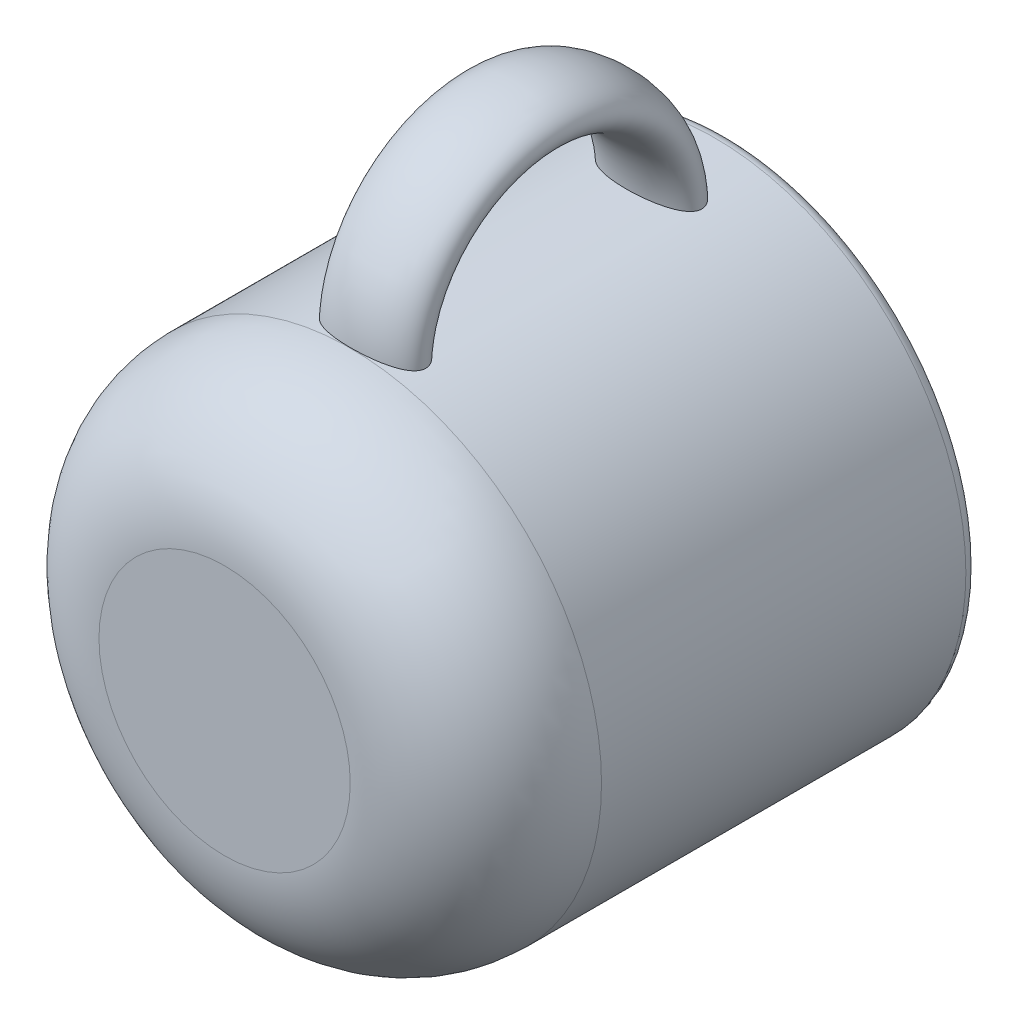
ISO-10303-21;
HEADER;
FILE_DESCRIPTION(('STEP AP214'),'2;1');
FILE_NAME('part.step','',(''),(''),'','','');
FILE_SCHEMA(('AUTOMOTIVE_DESIGN { 1 0 10303 214 1 1 1 1 }'));
ENDSEC;
DATA;
#1=APPLICATION_CONTEXT('core data for automotive mechanical design processes');
#2=APPLICATION_PROTOCOL_DEFINITION('international standard','automotive_design',2000,#1);
#3=PRODUCT_CONTEXT('',#1,'mechanical');
#4=PRODUCT('Part','Part','',(#3));
#5=PRODUCT_RELATED_PRODUCT_CATEGORY('part','',(#4));
#6=PRODUCT_DEFINITION_FORMATION('','',#4);
#7=PRODUCT_DEFINITION_CONTEXT('part definition',#1,'design');
#8=PRODUCT_DEFINITION('design','',#6,#7);
#9=PRODUCT_DEFINITION_SHAPE('','',#8);
#10=(LENGTH_UNIT() NAMED_UNIT(*) SI_UNIT(.MILLI.,.METRE.));
#11=(NAMED_UNIT(*) PLANE_ANGLE_UNIT() SI_UNIT($,.RADIAN.));
#12=(NAMED_UNIT(*) SI_UNIT($,.STERADIAN.) SOLID_ANGLE_UNIT());
#13=UNCERTAINTY_MEASURE_WITH_UNIT(LENGTH_MEASURE(1.E-05),#10,'distance_accuracy_value','');
#14=(GEOMETRIC_REPRESENTATION_CONTEXT(3) GLOBAL_UNCERTAINTY_ASSIGNED_CONTEXT((#13)) GLOBAL_UNIT_ASSIGNED_CONTEXT((#10,
#11,#12)) REPRESENTATION_CONTEXT('',''));
#15=CARTESIAN_POINT('',(0.,0.,0.));
#16=DIRECTION('',(0.,0.,1.));
#17=DIRECTION('',(1.,0.,0.));
#18=AXIS2_PLACEMENT_3D('',#15,#16,#17);
#19=CARTESIAN_POINT('',(0.,0.,200.));
#20=DIRECTION('',(0.,0.,-1.));
#21=DIRECTION('',(-1.,0.,0.));
#22=AXIS2_PLACEMENT_3D('',#19,#20,#21);
#23=CYLINDRICAL_SURFACE('',#22,100.);
#24=CARTESIAN_POINT('',(0.,0.,5.));
#25=DIRECTION('',(0.,0.,1.));
#26=DIRECTION('',(1.,0.,0.));
#27=AXIS2_PLACEMENT_3D('',#24,#25,#26);
#28=CIRCLE('',#27,100.);
#29=CARTESIAN_POINT('',(100.,0.,5.));
#30=VERTEX_POINT('',#29);
#31=EDGE_CURVE('E36',#30,#30,#28,.T.);
#32=ORIENTED_EDGE('',*,*,#31,.T.);
#33=EDGE_LOOP('',(#32));
#34=FACE_BOUND('',#33,.T.);
#35=CARTESIAN_POINT('',(-20.,97.9795897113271,30.0700787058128));
#36=CARTESIAN_POINT('',(-19.9999979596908,97.979590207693,30.222520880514));
#37=CARTESIAN_POINT('',(-19.9930275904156,97.9810137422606,30.3749876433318));
#38=CARTESIAN_POINT('',(-19.9653726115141,97.9866526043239,30.6786777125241));
#39=CARTESIAN_POINT('',(-19.9446807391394,97.9908694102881,30.8299003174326));
#40=CARTESIAN_POINT('',(-19.8901208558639,98.0019584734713,31.1301554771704));
#41=CARTESIAN_POINT('',(-19.8562263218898,98.0088360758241,31.2791829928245));
#42=CARTESIAN_POINT('',(-19.7761375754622,98.0250276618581,31.5737707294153));
#43=CARTESIAN_POINT('',(-19.729940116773,98.0343422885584,31.7193300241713));
#44=CARTESIAN_POINT('',(-19.6145049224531,98.0575106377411,32.0388254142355));
#45=CARTESIAN_POINT('',(-19.5424171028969,98.0719148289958,32.211694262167));
#46=CARTESIAN_POINT('',(-19.383367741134,98.103474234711,32.5501404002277));
#47=CARTESIAN_POINT('',(-19.2964020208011,98.1206302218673,32.7157156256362));
#48=CARTESIAN_POINT('',(-19.0160353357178,98.1754877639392,33.2011532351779));
#49=CARTESIAN_POINT('',(-18.8032316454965,98.216565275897,33.5095525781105));
#50=CARTESIAN_POINT('',(-18.389019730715,98.294856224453,34.0334226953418));
#51=CARTESIAN_POINT('',(-18.1946247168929,98.3310658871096,34.2547978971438));
#52=CARTESIAN_POINT('',(-17.7873297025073,98.4055574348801,34.6796614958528));
#53=CARTESIAN_POINT('',(-17.5744185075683,98.4438405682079,34.883138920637));
#54=CARTESIAN_POINT('',(-17.1337203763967,98.5214992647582,35.2737414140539));
#55=CARTESIAN_POINT('',(-16.9059074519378,98.5608766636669,35.4608365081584));
#56=CARTESIAN_POINT('',(-16.4385770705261,98.6398975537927,35.8197670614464));
#57=CARTESIAN_POINT('',(-16.1990565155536,98.6795411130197,35.9915984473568));
#58=CARTESIAN_POINT('',(-15.655632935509,98.7673677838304,36.3583277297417));
#59=CARTESIAN_POINT('',(-15.3493611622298,98.8154671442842,36.5497271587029));
#60=CARTESIAN_POINT('',(-14.7254407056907,98.9103690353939,36.9137135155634));
#61=CARTESIAN_POINT('',(-14.4077843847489,98.9571706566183,37.0862874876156));
#62=CARTESIAN_POINT('',(-13.7633834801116,99.0488527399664,37.4142455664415));
#63=CARTESIAN_POINT('',(-13.4366365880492,99.0937327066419,37.569625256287));
#64=CARTESIAN_POINT('',(-12.7752636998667,99.1811680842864,37.8647890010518));
#65=CARTESIAN_POINT('',(-12.4406259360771,99.2237196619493,38.0045477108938));
#66=CARTESIAN_POINT('',(-11.7653781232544,99.3060498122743,38.2692931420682));
#67=CARTESIAN_POINT('',(-11.4247702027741,99.3458293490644,38.3942850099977));
#68=CARTESIAN_POINT('',(-10.7384718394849,99.4223539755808,38.6304967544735));
#69=CARTESIAN_POINT('',(-10.3927810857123,99.459098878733,38.7417157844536));
#70=CARTESIAN_POINT('',(-9.61321163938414,99.5378039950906,38.9764172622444));
#71=CARTESIAN_POINT('',(-9.1781832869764,99.5788828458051,39.0963820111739));
#72=CARTESIAN_POINT('',(-8.30283976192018,99.6556870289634,39.3174382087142));
#73=CARTESIAN_POINT('',(-7.86252371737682,99.6914114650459,39.4185264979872));
#74=CARTESIAN_POINT('',(-6.97750832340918,99.7572622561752,39.6027422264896));
#75=CARTESIAN_POINT('',(-6.53280684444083,99.7873857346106,39.685860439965));
#76=CARTESIAN_POINT('',(-5.6401899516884,99.8418159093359,39.8347406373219));
#77=CARTESIAN_POINT('',(-5.19227470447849,99.866122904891,39.9005035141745));
#78=CARTESIAN_POINT('',(-4.29310384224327,99.908819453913,40.0152956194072));
#79=CARTESIAN_POINT('',(-3.8418433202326,99.9271970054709,40.0642909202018));
#80=CARTESIAN_POINT('',(-2.93761360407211,99.9578673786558,40.1457160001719));
#81=CARTESIAN_POINT('',(-2.48464424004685,99.9701595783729,40.1781440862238));
#82=CARTESIAN_POINT('',(-1.12452340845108,99.9977835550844,40.2509235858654));
#83=CARTESIAN_POINT('',(-0.215702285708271,100.003884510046,40.2668278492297));
#84=CARTESIAN_POINT('',(1.31698520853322,99.9932824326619,40.2389844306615));
#85=CARTESIAN_POINT('',(1.94130408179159,99.9830993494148,40.2122973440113));
#86=CARTESIAN_POINT('',(3.18768867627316,99.9511234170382,40.1278706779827));
#87=CARTESIAN_POINT('',(3.80975406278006,99.9293289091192,40.0701266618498));
#88=CARTESIAN_POINT('',(5.04988829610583,99.8743415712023,39.9227806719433));
#89=CARTESIAN_POINT('',(5.66795518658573,99.8411435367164,39.8331641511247));
#90=CARTESIAN_POINT('',(6.89497410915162,99.7638985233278,39.6212569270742));
#91=CARTESIAN_POINT('',(7.50395447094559,99.7199005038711,39.4991134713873));
#92=CARTESIAN_POINT('',(8.71284643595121,99.6215537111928,39.2201157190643));
#93=CARTESIAN_POINT('',(9.31276146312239,99.5672089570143,39.0632748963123));
#94=CARTESIAN_POINT('',(10.5001465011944,99.4489930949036,38.7122357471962));
#95=CARTESIAN_POINT('',(11.0876277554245,99.3851310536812,38.5180729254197));
#96=CARTESIAN_POINT('',(11.9694150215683,99.2815496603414,38.1910382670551));
#97=CARTESIAN_POINT('',(12.2697038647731,99.244871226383,38.0731976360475));
#98=CARTESIAN_POINT('',(12.8650003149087,99.1694595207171,37.8254761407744));
#99=CARTESIAN_POINT('',(13.1600085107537,99.1307264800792,37.69559662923));
#100=CARTESIAN_POINT('',(13.744134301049,99.0514298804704,37.4227421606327));
#101=CARTESIAN_POINT('',(14.0332439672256,99.0108640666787,37.2797508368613));
#102=CARTESIAN_POINT('',(14.6039167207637,98.9283009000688,36.9797476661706));
#103=CARTESIAN_POINT('',(14.8854798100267,98.8863035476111,36.8227358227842));
#104=CARTESIAN_POINT('',(15.4416824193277,98.8009829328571,36.4920742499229));
#105=CARTESIAN_POINT('',(15.7162463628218,98.7576516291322,36.3182988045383));
#106=CARTESIAN_POINT('',(16.2538609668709,98.6705941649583,35.953633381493));
#107=CARTESIAN_POINT('',(16.5169089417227,98.6268679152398,35.7627394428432));
#108=CARTESIAN_POINT('',(17.0278312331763,98.5399406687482,35.362549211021));
#109=CARTESIAN_POINT('',(17.2757395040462,98.4967386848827,35.1532968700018));
#110=CARTESIAN_POINT('',(17.7527455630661,98.4118828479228,34.7142929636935));
#111=CARTESIAN_POINT('',(17.9818569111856,98.3702278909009,34.4845564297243));
#112=CARTESIAN_POINT('',(18.4350605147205,98.2863470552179,33.9812334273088));
#113=CARTESIAN_POINT('',(18.6569511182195,98.2443913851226,33.7055683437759));
#114=CARTESIAN_POINT('',(18.960728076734,98.1860557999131,33.2711531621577));
#115=CARTESIAN_POINT('',(19.0571698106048,98.1673717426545,33.122811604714));
#116=CARTESIAN_POINT('',(19.2388608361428,98.1319253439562,32.8191165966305));
#117=CARTESIAN_POINT('',(19.3241084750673,98.1151632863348,32.6637621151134));
#118=CARTESIAN_POINT('',(19.4828000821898,98.0837761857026,32.3441432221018));
#119=CARTESIAN_POINT('',(19.5560615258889,98.0691844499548,32.1797843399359));
#120=CARTESIAN_POINT('',(19.6874246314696,98.0428977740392,31.8449623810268));
#121=CARTESIAN_POINT('',(19.7455356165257,98.0312010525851,31.674503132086));
#122=CARTESIAN_POINT('',(19.8448057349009,98.0111537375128,31.3287861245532));
#123=CARTESIAN_POINT('',(19.8859920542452,98.0027977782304,31.1535365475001));
#124=CARTESIAN_POINT('',(19.9500672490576,97.9897744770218,30.7995856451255));
#125=CARTESIAN_POINT('',(19.9729602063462,97.9851063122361,30.6208850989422));
#126=CARTESIAN_POINT('',(19.9977362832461,97.9800524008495,30.2863547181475));
#127=CARTESIAN_POINT('',(20.0020470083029,97.9791718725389,30.1307087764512));
#128=CARTESIAN_POINT('',(19.9961571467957,97.9803741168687,29.8197103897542));
#129=CARTESIAN_POINT('',(19.985957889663,97.9824566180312,29.6643579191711));
#130=CARTESIAN_POINT('',(19.9512994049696,97.9895196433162,29.3552644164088));
#131=CARTESIAN_POINT('',(19.9268341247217,97.9945013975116,29.2015240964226));
#132=CARTESIAN_POINT('',(19.8642890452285,98.0071988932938,28.896967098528));
#133=CARTESIAN_POINT('',(19.8262090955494,98.0149146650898,28.7461504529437));
#134=CARTESIAN_POINT('',(19.7416488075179,98.0319793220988,28.4627699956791));
#135=CARTESIAN_POINT('',(19.6963261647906,98.0411002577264,28.3298440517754));
#136=CARTESIAN_POINT('',(19.5961518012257,98.0611719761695,28.0677568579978));
#137=CARTESIAN_POINT('',(19.5412968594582,98.0721233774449,27.9385968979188));
#138=CARTESIAN_POINT('',(19.3637752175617,98.1073835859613,27.5575036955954));
#139=CARTESIAN_POINT('',(19.2280923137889,98.1341105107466,27.3117649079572));
#140=CARTESIAN_POINT('',(18.9514840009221,98.1878711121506,26.8741656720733));
#141=CARTESIAN_POINT('',(18.8143791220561,98.2142608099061,26.6797445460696));
#142=CARTESIAN_POINT('',(18.5236863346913,98.2695015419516,26.3038773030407));
#143=CARTESIAN_POINT('',(18.3700886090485,98.2983540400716,26.122439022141));
#144=CARTESIAN_POINT('',(18.0491168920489,98.3577963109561,25.7717418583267));
#145=CARTESIAN_POINT('',(17.8817089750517,98.388390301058,25.6025150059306));
#146=CARTESIAN_POINT('',(17.5358190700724,98.4506269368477,25.2759118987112));
#147=CARTESIAN_POINT('',(17.3573327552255,98.4822699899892,25.1185403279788));
#148=CARTESIAN_POINT('',(17.0137992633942,98.5421594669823,24.8335834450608));
#149=CARTESIAN_POINT('',(16.8497989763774,98.5703450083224,24.7047151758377));
#150=CARTESIAN_POINT('',(16.5158956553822,98.6268416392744,24.455009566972));
#151=CARTESIAN_POINT('',(16.3459938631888,98.6551527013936,24.3341705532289));
#152=CARTESIAN_POINT('',(15.8284302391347,98.7399758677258,23.9826871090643));
#153=CARTESIAN_POINT('',(15.4731041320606,98.7963439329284,23.7632341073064));
#154=CARTESIAN_POINT('',(14.7469717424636,98.9073409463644,23.3504112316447));
#155=CARTESIAN_POINT('',(14.3761468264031,98.9619676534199,23.1570740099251));
#156=CARTESIAN_POINT('',(13.6227994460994,99.0684820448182,22.7937501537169));
#157=CARTESIAN_POINT('',(13.2402740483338,99.1203690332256,22.6237694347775));
#158=CARTESIAN_POINT('',(12.3725437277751,99.2328321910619,22.2662429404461));
#159=CARTESIAN_POINT('',(11.8848786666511,99.2924752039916,22.0843902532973));
#160=CARTESIAN_POINT('',(10.8987941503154,99.4055475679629,21.7494186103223));
#161=CARTESIAN_POINT('',(10.4003675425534,99.4589726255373,21.5963194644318));
#162=CARTESIAN_POINT('',(9.39543573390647,99.5589315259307,21.3162755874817));
#163=CARTESIAN_POINT('',(8.88892838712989,99.6054635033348,21.1893379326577));
#164=CARTESIAN_POINT('',(7.86849546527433,99.691271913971,20.9593212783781));
#165=CARTESIAN_POINT('',(7.35455347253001,99.7305282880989,20.8563080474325));
#166=CARTESIAN_POINT('',(6.32229645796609,99.8012831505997,20.6730769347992));
#167=CARTESIAN_POINT('',(5.80398302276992,99.8327843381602,20.5928511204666));
#168=CARTESIAN_POINT('',(4.76406940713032,99.8878111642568,20.4540269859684));
#169=CARTESIAN_POINT('',(4.24246920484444,99.9113367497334,20.3954288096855));
#170=CARTESIAN_POINT('',(3.02746731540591,99.9565614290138,20.2834338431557));
#171=CARTESIAN_POINT('',(2.33321524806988,99.9751931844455,20.2378887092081));
#172=CARTESIAN_POINT('',(0.9428663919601,99.9979732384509,20.1822871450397));
#173=CARTESIAN_POINT('',(0.246769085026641,100.002116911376,20.1722420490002));
#174=CARTESIAN_POINT('',(-1.14527094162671,99.9958648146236,20.1874545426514));
#175=CARTESIAN_POINT('',(-1.84121347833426,99.9854630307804,20.2127267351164));
#176=CARTESIAN_POINT('',(-3.22786484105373,99.9502877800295,20.2989978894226));
#177=CARTESIAN_POINT('',(-3.91858350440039,99.9255693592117,20.3598600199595));
#178=CARTESIAN_POINT('',(-5.29486484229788,99.8620988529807,20.5185589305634));
#179=CARTESIAN_POINT('',(-5.98042939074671,99.8233521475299,20.6163815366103));
#180=CARTESIAN_POINT('',(-7.34349814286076,99.7323367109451,20.8512730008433));
#181=CARTESIAN_POINT('',(-8.02100782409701,99.680077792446,20.9883133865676));
#182=CARTESIAN_POINT('',(-9.11472680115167,99.5846438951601,21.2462668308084));
#183=CARTESIAN_POINT('',(-9.53436061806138,99.5453242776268,21.3542070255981));
#184=CARTESIAN_POINT('',(-10.3680650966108,99.4619455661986,21.5882074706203));
#185=CARTESIAN_POINT('',(-10.7821362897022,99.4178869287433,21.7142659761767));
#186=CARTESIAN_POINT('',(-11.6044077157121,99.3252705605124,21.9863818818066));
#187=CARTESIAN_POINT('',(-12.0125893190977,99.2767011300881,22.1324917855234));
#188=CARTESIAN_POINT('',(-12.8200939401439,99.1756554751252,22.4463859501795));
#189=CARTESIAN_POINT('',(-13.2194174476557,99.1231794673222,22.6141690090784));
#190=CARTESIAN_POINT('',(-13.8787621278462,99.0325805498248,22.9154189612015));
#191=CARTESIAN_POINT('',(-14.1419043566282,98.9953313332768,23.0423328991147));
#192=CARTESIAN_POINT('',(-14.6619883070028,98.9196397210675,23.30809369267));
#193=CARTESIAN_POINT('',(-14.9189292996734,98.8811971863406,23.4469419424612));
#194=CARTESIAN_POINT('',(-15.4254412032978,98.8034485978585,23.737711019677));
#195=CARTESIAN_POINT('',(-15.675006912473,98.7641419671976,23.8896407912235));
#196=CARTESIAN_POINT('',(-16.163614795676,98.685350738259,24.2068870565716));
#197=CARTESIAN_POINT('',(-16.4027052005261,98.6458681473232,24.3721293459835));
#198=CARTESIAN_POINT('',(-16.869419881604,98.5671276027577,24.7179433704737));
#199=CARTESIAN_POINT('',(-17.09705041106,98.527869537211,24.8985065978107));
#200=CARTESIAN_POINT('',(-17.5378492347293,98.4503620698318,25.2763076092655));
#201=CARTESIAN_POINT('',(-17.751036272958,98.4121114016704,25.4735230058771));
#202=CARTESIAN_POINT('',(-18.0805259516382,98.3519744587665,25.8065541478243));
#203=CARTESIAN_POINT('',(-18.2024686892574,98.3294694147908,25.9366948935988));
#204=CARTESIAN_POINT('',(-18.438423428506,98.2854970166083,26.2041626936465));
#205=CARTESIAN_POINT('',(-18.5524361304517,98.2640295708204,26.341489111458));
#206=CARTESIAN_POINT('',(-18.7713036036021,98.2224545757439,26.6236371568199));
#207=CARTESIAN_POINT('',(-18.876151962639,98.2023479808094,26.7684639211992));
#208=CARTESIAN_POINT('',(-19.0751193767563,98.1638940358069,27.0656402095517));
#209=CARTESIAN_POINT('',(-19.1692348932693,98.14554726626,27.217992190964));
#210=CARTESIAN_POINT('',(-19.3462752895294,98.1108041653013,27.532289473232));
#211=CARTESIAN_POINT('',(-19.4290168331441,98.0944402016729,27.6943423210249));
#212=CARTESIAN_POINT('',(-19.5796976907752,98.064475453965,28.0253544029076));
#213=CARTESIAN_POINT('',(-19.6476468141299,98.0508728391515,28.1943089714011));
#214=CARTESIAN_POINT('',(-19.766722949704,98.0269368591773,28.537700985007));
#215=CARTESIAN_POINT('',(-19.8179028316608,98.0165932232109,28.7121192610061));
#216=CARTESIAN_POINT('',(-19.9020351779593,97.9995452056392,29.065378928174));
#217=CARTESIAN_POINT('',(-19.9350037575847,97.9928376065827,29.244216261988));
#218=CARTESIAN_POINT('',(-19.972149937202,97.985271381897,29.5313184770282));
#219=CARTESIAN_POINT('',(-19.982581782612,97.983143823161,29.6387747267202));
#220=CARTESIAN_POINT('',(-19.9965080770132,97.9803027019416,29.8541760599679));
#221=CARTESIAN_POINT('',(-20.0000014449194,97.9795893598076,29.9621212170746));
#222=CARTESIAN_POINT('',(-20.,97.9795897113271,30.0700787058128));
#223=B_SPLINE_CURVE_WITH_KNOTS('',3,(#35,#36,#37,#38,#39,#40,#41,#42,#43,#44,#45,#46,#47,#48,
#49,#50,#51,#52,#53,#54,#55,#56,#57,#58,#59,#60,#61,#62,#63,#64,#65,#66,#67,#68,#69,#70,#71,#72,
#73,#74,#75,#76,#77,#78,#79,#80,#81,#82,#83,#84,#85,#86,#87,#88,#89,#90,#91,#92,#93,#94,#95,#96,
#97,#98,#99,#100,#101,#102,#103,#104,#105,#106,#107,#108,#109,#110,#111,#112,#113,#114,#115,
#116,#117,#118,#119,#120,#121,#122,#123,#124,#125,#126,#127,#128,#129,#130,#131,#132,#133,#134,
#135,#136,#137,#138,#139,#140,#141,#142,#143,#144,#145,#146,#147,#148,#149,#150,#151,#152,#153,
#154,#155,#156,#157,#158,#159,#160,#161,#162,#163,#164,#165,#166,#167,#168,#169,#170,#171,#172,
#173,#174,#175,#176,#177,#178,#179,#180,#181,#182,#183,#184,#185,#186,#187,#188,#189,#190,#191,
#192,#193,#194,#195,#196,#197,#198,#199,#200,#201,#202,#203,#204,#205,#206,#207,#208,#209,#210,
#211,#212,#213,#214,#215,#216,#217,#218,#219,#220,#221,#222),.UNSPECIFIED.,.T.,.F.,(4,2,2,2,2,2,
2,2,2,2,2,2,2,2,2,2,2,2,2,2,2,2,2,2,2,2,2,2,2,2,2,2,2,2,2,2,2,2,2,2,2,2,2,2,2,2,2,2,2,2,2,2,2,2,
2,2,2,2,2,2,2,2,2,2,2,2,2,2,2,2,2,2,2,2,2,2,2,2,2,2,2,2,2,2,2,2,2,2,2,2,2,2,2,4),(0.,
0.457206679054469,0.914655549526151,1.37302817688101,1.83152186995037,2.39419393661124,
2.95702427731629,4.08324126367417,4.9726407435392,5.86258171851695,6.75411838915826,
7.64589226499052,8.73814206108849,9.83113887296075,10.9244158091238,12.0194416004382,
13.1140846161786,14.208794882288,15.5676866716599,16.9268056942,18.2866208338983,
19.6463659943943,21.0088464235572,22.3714660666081,25.095325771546,26.9694851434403,
28.8439123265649,30.7191961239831,32.5861308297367,34.4523418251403,36.3167861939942,
37.2905482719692,38.2642010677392,39.2390862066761,40.2139710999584,41.1968391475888,
42.1799352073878,43.1607387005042,44.1408283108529,45.2068569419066,45.7402087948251,
46.2736393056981,46.8145590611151,47.3551451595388,47.8948594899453,48.4344533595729,
48.9008924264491,49.3672887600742,49.8338831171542,50.3004826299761,50.7222792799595,
51.1442187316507,51.9874984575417,52.7046300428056,53.4221908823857,54.1415701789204,
54.861232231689,55.492385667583,56.123407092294,57.3862043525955,58.650566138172,
59.9152475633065,61.4857683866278,63.0573672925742,64.6293907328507,66.205685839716,
67.7814315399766,69.3571877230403,71.4440363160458,73.5315511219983,75.6199293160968,
77.7003307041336,79.7799350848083,81.8580334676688,83.162884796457,84.4676105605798,
85.7758202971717,87.0839575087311,87.9672368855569,88.8506195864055,89.7346111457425,
90.6139772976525,91.4928582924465,92.3705759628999,92.9095819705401,93.4485403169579,
93.9878727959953,94.5273825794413,95.0747649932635,95.621783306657,96.1670600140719,
96.7118534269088,97.0355905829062,97.3593781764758),.UNSPECIFIED.);
#224=CARTESIAN_POINT('',(-20.,97.9795897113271,30.0700787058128));
#225=VERTEX_POINT('',#224);
#226=EDGE_CURVE('E49',#225,#225,#223,.T.);
#227=ORIENTED_EDGE('',*,*,#226,.F.);
#228=EDGE_LOOP('',(#227));
#229=FACE_BOUND('',#228,.T.);
#230=CARTESIAN_POINT('',(0.,0.,150.));
#231=DIRECTION('',(0.,0.,1.));
#232=DIRECTION('',(1.,0.,0.));
#233=AXIS2_PLACEMENT_3D('',#230,#231,#232);
#234=CIRCLE('',#233,100.);
#235=CARTESIAN_POINT('',(100.,0.,150.));
#236=VERTEX_POINT('',#235);
#237=EDGE_CURVE('E76',#236,#236,#234,.F.);
#238=ORIENTED_EDGE('',*,*,#237,.T.);
#239=EDGE_LOOP('',(#238));
#240=FACE_BOUND('',#239,.T.);
#241=CARTESIAN_POINT('',(-20.,97.9795897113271,139.929215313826));
#242=CARTESIAN_POINT('',(-19.9999981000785,97.9795901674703,140.079774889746));
#243=CARTESIAN_POINT('',(-19.9931994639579,97.9809786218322,140.230352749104));
#244=CARTESIAN_POINT('',(-19.9661492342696,97.9864943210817,140.530252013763));
#245=CARTESIAN_POINT('',(-19.9458955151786,97.9906219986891,140.679573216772));
#246=CARTESIAN_POINT('',(-19.8924184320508,98.0014919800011,140.975902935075));
#247=CARTESIAN_POINT('',(-19.8591836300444,98.0082365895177,141.12290929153));
#248=CARTESIAN_POINT('',(-19.7805401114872,98.0241390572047,141.413473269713));
#249=CARTESIAN_POINT('',(-19.7351314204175,98.0332969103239,141.557030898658));
#250=CARTESIAN_POINT('',(-19.633544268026,98.0536923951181,141.838758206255));
#251=CARTESIAN_POINT('',(-19.5774585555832,98.0649120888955,141.976962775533));
#252=CARTESIAN_POINT('',(-19.4553131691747,98.0892179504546,142.24874432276));
#253=CARTESIAN_POINT('',(-19.389249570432,98.1023048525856,142.382319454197));
#254=CARTESIAN_POINT('',(-19.1777029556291,98.1439568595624,142.77550759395));
#255=CARTESIAN_POINT('',(-19.0188060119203,98.1749250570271,143.027738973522));
#256=CARTESIAN_POINT('',(-18.6949737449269,98.237068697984,143.480938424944));
#257=CARTESIAN_POINT('',(-18.5332974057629,98.2677306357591,143.684367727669));
#258=CARTESIAN_POINT('',(-18.1927769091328,98.3313422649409,144.076092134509));
#259=CARTESIAN_POINT('',(-18.013921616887,98.3642934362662,144.264377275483));
#260=CARTESIAN_POINT('',(-17.642055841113,98.4316701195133,144.627001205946));
#261=CARTESIAN_POINT('',(-17.4490103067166,98.4660991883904,144.801303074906));
#262=CARTESIAN_POINT('',(-17.051719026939,98.5356766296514,145.13657351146));
#263=CARTESIAN_POINT('',(-16.8474689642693,98.5708252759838,145.297536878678));
#264=CARTESIAN_POINT('',(-16.4509635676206,98.63773143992,145.591477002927));
#265=CARTESIAN_POINT('',(-16.2595782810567,98.6694731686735,145.725638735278));
#266=CARTESIAN_POINT('',(-15.8706569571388,98.7327760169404,145.984669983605));
#267=CARTESIAN_POINT('',(-15.6731219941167,98.7643371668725,146.109541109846));
#268=CARTESIAN_POINT('',(-15.2726613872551,98.8270555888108,146.350758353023));
#269=CARTESIAN_POINT('',(-15.069731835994,98.858212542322,146.467098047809));
#270=CARTESIAN_POINT('',(-14.6593672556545,98.9198971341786,146.691740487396));
#271=CARTESIAN_POINT('',(-14.4519316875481,98.9504246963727,146.800042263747));
#272=CARTESIAN_POINT('',(-13.8232652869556,99.0408830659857,147.113965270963));
#273=CARTESIAN_POINT('',(-13.3961869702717,99.0996089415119,147.308300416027));
#274=CARTESIAN_POINT('',(-12.5305619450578,99.2127802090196,147.670255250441));
#275=CARTESIAN_POINT('',(-12.0920174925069,99.2672264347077,147.837880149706));
#276=CARTESIAN_POINT('',(-11.1102302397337,99.3823769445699,148.182845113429));
#277=CARTESIAN_POINT('',(-10.5648374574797,99.4418918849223,148.354459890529));
#278=CARTESIAN_POINT('',(-9.46398808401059,99.5526963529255,148.666084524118));
#279=CARTESIAN_POINT('',(-8.9085251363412,99.6039804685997,148.806073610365));
#280=CARTESIAN_POINT('',(-7.79022167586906,99.6976799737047,149.057052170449));
#281=CARTESIAN_POINT('',(-7.22737915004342,99.7400928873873,149.168033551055));
#282=CARTESIAN_POINT('',(-6.09526219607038,99.815681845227,149.363121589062));
#283=CARTESIAN_POINT('',(-5.52597682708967,99.8488384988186,149.447171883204));
#284=CARTESIAN_POINT('',(-4.38393020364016,99.90549497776,149.589462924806));
#285=CARTESIAN_POINT('',(-3.81117021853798,99.9289981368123,149.647712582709));
#286=CARTESIAN_POINT('',(-2.66340234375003,99.9661741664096,149.739366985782));
#287=CARTESIAN_POINT('',(-2.088394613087,99.9798477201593,149.772773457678));
#288=CARTESIAN_POINT('',(-0.899603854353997,99.9978342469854,149.816658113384));
#289=CARTESIAN_POINT('',(-0.285749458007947,100.001474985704,149.825490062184));
#290=CARTESIAN_POINT('',(0.941782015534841,99.997449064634,149.815694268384));
#291=CARTESIAN_POINT('',(1.55545905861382,99.9897809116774,149.79706289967));
#292=CARTESIAN_POINT('',(2.78128673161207,99.9631951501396,149.732001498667));
#293=CARTESIAN_POINT('',(3.39343685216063,99.944274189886,149.685563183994));
#294=CARTESIAN_POINT('',(4.61223726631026,99.8954345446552,149.564280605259));
#295=CARTESIAN_POINT('',(5.21889947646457,99.865556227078,149.489540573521));
#296=CARTESIAN_POINT('',(6.42704169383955,99.7950859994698,149.310296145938));
#297=CARTESIAN_POINT('',(7.02852301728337,99.754496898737,149.205799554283));
#298=CARTESIAN_POINT('',(8.22402677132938,99.6630542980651,148.96506769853));
#299=CARTESIAN_POINT('',(8.81805339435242,99.6122068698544,148.828851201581));
#300=CARTESIAN_POINT('',(9.79020048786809,99.5203507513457,148.575452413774));
#301=CARTESIAN_POINT('',(10.1712052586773,99.4821163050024,148.468262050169));
#302=CARTESIAN_POINT('',(10.9280261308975,99.4018258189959,148.238170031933));
#303=CARTESIAN_POINT('',(11.3038426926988,99.3597701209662,148.115269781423));
#304=CARTESIAN_POINT('',(12.0498877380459,99.2720583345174,147.852194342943));
#305=CARTESIAN_POINT('',(12.4201026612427,99.2263947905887,147.7119830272));
#306=CARTESIAN_POINT('',(13.1525382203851,99.1319678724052,147.412899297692));
#307=CARTESIAN_POINT('',(13.514759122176,99.0832046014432,147.254027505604));
#308=CARTESIAN_POINT('',(14.232815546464,98.9826231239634,146.913898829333));
#309=CARTESIAN_POINT('',(14.5885469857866,98.9307786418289,146.732428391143));
#310=CARTESIAN_POINT('',(15.2869033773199,98.8252768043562,146.345845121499));
#311=CARTESIAN_POINT('',(15.6295232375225,98.7716187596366,146.140723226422));
#312=CARTESIAN_POINT('',(16.2961581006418,98.6638159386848,145.704602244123));
#313=CARTESIAN_POINT('',(16.620239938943,98.6096738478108,145.473706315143));
#314=CARTESIAN_POINT('',(17.0886345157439,98.5292026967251,145.105025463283));
#315=CARTESIAN_POINT('',(17.241761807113,98.5025116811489,144.978456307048));
#316=CARTESIAN_POINT('',(17.5411461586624,98.4496381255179,144.717358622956));
#317=CARTESIAN_POINT('',(17.6874048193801,98.4234554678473,144.582831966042));
#318=CARTESIAN_POINT('',(17.9576528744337,98.3744867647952,144.31919968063));
#319=CARTESIAN_POINT('',(18.0824075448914,98.3516226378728,144.190894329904));
#320=CARTESIAN_POINT('',(18.3243113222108,98.306839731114,143.927140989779));
#321=CARTESIAN_POINT('',(18.4414611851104,98.2849208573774,143.791693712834));
#322=CARTESIAN_POINT('',(18.6669602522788,98.24234203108,143.513340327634));
#323=CARTESIAN_POINT('',(18.7753055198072,98.2216826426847,143.37043092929));
#324=CARTESIAN_POINT('',(18.9817039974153,98.1820042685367,143.077042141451));
#325=CARTESIAN_POINT('',(19.0797539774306,98.1629857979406,142.926560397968));
#326=CARTESIAN_POINT('',(19.2650845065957,98.126783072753,142.616092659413));
#327=CARTESIAN_POINT('',(19.352204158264,98.1096266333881,142.456006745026));
#328=CARTESIAN_POINT('',(19.5121803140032,98.077935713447,142.128689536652));
#329=CARTESIAN_POINT('',(19.5850458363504,98.0633995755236,141.961462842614));
#330=CARTESIAN_POINT('',(19.7145454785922,98.0374472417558,141.620865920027));
#331=CARTESIAN_POINT('',(19.7712052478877,98.0260261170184,141.44750589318));
#332=CARTESIAN_POINT('',(19.8666606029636,98.006725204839,141.095731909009));
#333=CARTESIAN_POINT('',(19.9054599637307,97.9988446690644,140.91731902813));
#334=CARTESIAN_POINT('',(19.9606518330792,97.9876169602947,140.576938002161));
#335=CARTESIAN_POINT('',(19.9790301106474,97.9838683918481,140.415304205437));
#336=CARTESIAN_POINT('',(20.0000183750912,97.9795865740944,140.090972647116));
#337=CARTESIAN_POINT('',(20.0026295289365,97.97905308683,139.928274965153));
#338=CARTESIAN_POINT('',(19.9920470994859,97.9812128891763,139.603400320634));
#339=CARTESIAN_POINT('',(19.9788511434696,97.9839066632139,139.441223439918));
#340=CARTESIAN_POINT('',(19.9371185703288,97.9924066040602,139.118953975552));
#341=CARTESIAN_POINT('',(19.9085823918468,97.9982126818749,138.958861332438));
#342=CARTESIAN_POINT('',(19.8420800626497,98.0116974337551,138.664299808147));
#343=CARTESIAN_POINT('',(19.8059947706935,98.0189998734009,138.529382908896));
#344=CARTESIAN_POINT('',(19.7238844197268,98.0355554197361,138.262709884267));
#345=CARTESIAN_POINT('',(19.6778564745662,98.0448090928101,138.130954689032));
#346=CARTESIAN_POINT('',(19.5261324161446,98.075179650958,137.741362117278));
#347=CARTESIAN_POINT('',(19.4067527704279,98.0989149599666,137.48901386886));
#348=CARTESIAN_POINT('',(19.0538758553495,98.1682164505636,136.847868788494));
#349=CARTESIAN_POINT('',(18.795830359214,98.2181235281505,136.473086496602));
#350=CARTESIAN_POINT('',(18.3686230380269,98.2986020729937,135.945058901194));
#351=CARTESIAN_POINT('',(18.219202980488,98.3264237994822,135.774444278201));
#352=CARTESIAN_POINT('',(17.9090901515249,98.3833787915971,135.443972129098));
#353=CARTESIAN_POINT('',(17.7483995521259,98.4125118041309,135.284112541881));
#354=CARTESIAN_POINT('',(17.4403952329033,98.4675258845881,134.995843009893));
#355=CARTESIAN_POINT('',(17.2942714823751,98.4933046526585,134.866127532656));
#356=CARTESIAN_POINT('',(16.9960292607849,98.545207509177,134.613834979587));
#357=CARTESIAN_POINT('',(16.8439100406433,98.5713316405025,134.491258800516));
#358=CARTESIAN_POINT('',(16.3796608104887,98.6499116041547,134.133504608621));
#359=CARTESIAN_POINT('',(16.0597553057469,98.7025541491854,133.908407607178));
#360=CARTESIAN_POINT('',(15.4039085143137,98.8070351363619,133.481916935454));
#361=CARTESIAN_POINT('',(15.0679441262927,98.8588722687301,133.280558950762));
#362=CARTESIAN_POINT('',(14.3837212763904,98.9607410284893,132.899334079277));
#363=CARTESIAN_POINT('',(14.0354596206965,99.0107721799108,132.719472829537));
#364=CARTESIAN_POINT('',(13.2508648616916,99.119141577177,132.341498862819));
#365=CARTESIAN_POINT('',(12.8121368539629,99.1768596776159,132.148192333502));
#366=CARTESIAN_POINT('',(11.9232620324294,99.2876460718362,131.787672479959));
#367=CARTESIAN_POINT('',(11.4731078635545,99.3407112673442,131.620476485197));
#368=CARTESIAN_POINT('',(10.5639314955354,99.4415034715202,131.310067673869));
#369=CARTESIAN_POINT('',(10.10490711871,99.4892291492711,131.166860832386));
#370=CARTESIAN_POINT('',(9.17915563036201,99.578912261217,130.902566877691));
#371=CARTESIAN_POINT('',(8.71241672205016,99.6208597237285,130.781517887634));
#372=CARTESIAN_POINT('',(7.77362322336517,99.6985083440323,130.560589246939));
#373=CARTESIAN_POINT('',(7.30157041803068,99.734211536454,130.460702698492));
#374=CARTESIAN_POINT('',(6.35319874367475,99.7991121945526,130.281079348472));
#375=CARTESIAN_POINT('',(5.87687970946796,99.82830940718,130.201343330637));
#376=CARTESIAN_POINT('',(4.91115090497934,99.8805248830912,130.059864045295));
#377=CARTESIAN_POINT('',(4.42167416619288,99.9034028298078,129.998527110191));
#378=CARTESIAN_POINT('',(3.4403218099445,99.9420099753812,129.895565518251));
#379=CARTESIAN_POINT('',(2.94844592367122,99.957738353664,129.853943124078));
#380=CARTESIAN_POINT('',(1.96310007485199,99.9819443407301,129.790063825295));
#381=CARTESIAN_POINT('',(1.46962963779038,99.9904195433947,129.767813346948));
#382=CARTESIAN_POINT('',(0.482066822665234,100.000057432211,129.74251989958));
#383=CARTESIAN_POINT('',(-0.0120256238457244,100.001219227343,129.739479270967));
#384=CARTESIAN_POINT('',(-0.999647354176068,99.9962220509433,129.75258383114));
#385=CARTESIAN_POINT('',(-1.49317679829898,99.9900671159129,129.768718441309));
#386=CARTESIAN_POINT('',(-2.4790235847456,99.9704830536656,129.820282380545));
#387=CARTESIAN_POINT('',(-2.9713410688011,99.9570548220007,129.855709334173));
#388=CARTESIAN_POINT('',(-3.95373365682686,99.9230175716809,129.946129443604));
#389=CARTESIAN_POINT('',(-4.44380958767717,99.9024114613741,130.001114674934));
#390=CARTESIAN_POINT('',(-5.42090348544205,99.854158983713,130.131120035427));
#391=CARTESIAN_POINT('',(-5.90792172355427,99.8265132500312,130.206138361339));
#392=CARTESIAN_POINT('',(-7.00708643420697,99.7560993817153,130.399631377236));
#393=CARTESIAN_POINT('',(-7.61801381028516,99.7112646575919,130.524358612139));
#394=CARTESIAN_POINT('',(-8.83088201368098,99.6111721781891,130.809018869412));
#395=CARTESIAN_POINT('',(-9.43282236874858,99.5559138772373,130.968953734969));
#396=CARTESIAN_POINT('',(-10.3258193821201,99.4659082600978,131.237233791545));
#397=CARTESIAN_POINT('',(-10.6215798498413,99.4347502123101,131.331295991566));
#398=CARTESIAN_POINT('',(-11.2094871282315,99.3701906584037,131.529387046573));
#399=CARTESIAN_POINT('',(-11.5016342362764,99.3367893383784,131.633415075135));
#400=CARTESIAN_POINT('',(-12.0816232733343,99.2679184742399,131.851957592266));
#401=CARTESIAN_POINT('',(-12.3694666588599,99.2324496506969,131.966468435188));
#402=CARTESIAN_POINT('',(-12.9401874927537,99.1596404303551,132.206660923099));
#403=CARTESIAN_POINT('',(-13.2230654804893,99.1223002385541,132.332341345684));
#404=CARTESIAN_POINT('',(-13.8123563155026,99.0419923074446,132.609486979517));
#405=CARTESIAN_POINT('',(-14.1181263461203,98.9988450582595,132.762274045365));
#406=CARTESIAN_POINT('',(-14.7209313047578,98.9110050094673,133.083710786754));
#407=CARTESIAN_POINT('',(-15.0179682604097,98.8663125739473,133.252356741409));
#408=CARTESIAN_POINT('',(-15.6013110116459,98.775939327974,133.607069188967));
#409=CARTESIAN_POINT('',(-15.8876177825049,98.7302586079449,133.793134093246));
#410=CARTESIAN_POINT('',(-16.446736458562,98.6386587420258,134.184498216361));
#411=CARTESIAN_POINT('',(-16.7195524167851,98.5927396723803,134.389791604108));
#412=CARTESIAN_POINT('',(-17.1703010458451,98.5150581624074,134.758276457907));
#413=CARTESIAN_POINT('',(-17.3525678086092,98.4830989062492,134.916124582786));
#414=CARTESIAN_POINT('',(-17.7067409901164,98.4200368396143,135.243294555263));
#415=CARTESIAN_POINT('',(-17.8786466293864,98.3889340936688,135.412617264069));
#416=CARTESIAN_POINT('',(-18.2096263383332,98.3282145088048,135.763276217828));
#417=CARTESIAN_POINT('',(-18.3687175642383,98.2985957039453,135.944595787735));
#418=CARTESIAN_POINT('',(-18.6714107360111,98.2415500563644,136.319918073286));
#419=CARTESIAN_POINT('',(-18.8150196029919,98.214122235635,136.5139150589));
#420=CARTESIAN_POINT('',(-19.1328491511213,98.1527836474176,136.98902062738));
#421=CARTESIAN_POINT('',(-19.2989362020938,98.1201925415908,137.275950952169));
#422=CARTESIAN_POINT('',(-19.5133349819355,98.0776994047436,137.723154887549));
#423=CARTESIAN_POINT('',(-19.5789886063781,98.0646055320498,137.874944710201));
#424=CARTESIAN_POINT('',(-19.6973939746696,98.0408910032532,138.183694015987));
#425=CARTESIAN_POINT('',(-19.7501492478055,98.0302696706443,138.340652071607));
#426=CARTESIAN_POINT('',(-19.8290161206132,98.0143421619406,138.615671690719));
#427=CARTESIAN_POINT('',(-19.8584736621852,98.0083756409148,138.732744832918));
#428=CARTESIAN_POINT('',(-19.9093521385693,97.9980529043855,138.968688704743));
#429=CARTESIAN_POINT('',(-19.9307744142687,97.9936964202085,139.087559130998));
#430=CARTESIAN_POINT('',(-19.9652179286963,97.9866847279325,139.326582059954));
#431=CARTESIAN_POINT('',(-19.9782380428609,97.9840297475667,139.446734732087));
#432=CARTESIAN_POINT('',(-19.9956288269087,97.9804822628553,139.687659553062));
#433=CARTESIAN_POINT('',(-20.0000015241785,97.9795893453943,139.808431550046));
#434=CARTESIAN_POINT('',(-20.,97.9795897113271,139.929215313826));
#435=B_SPLINE_CURVE_WITH_KNOTS('',3,(#241,#242,#243,#244,#245,#246,#247,#248,#249,#250,#251,
#252,#253,#254,#255,#256,#257,#258,#259,#260,#261,#262,#263,#264,#265,#266,#267,#268,#269,#270,
#271,#272,#273,#274,#275,#276,#277,#278,#279,#280,#281,#282,#283,#284,#285,#286,#287,#288,#289,
#290,#291,#292,#293,#294,#295,#296,#297,#298,#299,#300,#301,#302,#303,#304,#305,#306,#307,#308,
#309,#310,#311,#312,#313,#314,#315,#316,#317,#318,#319,#320,#321,#322,#323,#324,#325,#326,#327,
#328,#329,#330,#331,#332,#333,#334,#335,#336,#337,#338,#339,#340,#341,#342,#343,#344,#345,#346,
#347,#348,#349,#350,#351,#352,#353,#354,#355,#356,#357,#358,#359,#360,#361,#362,#363,#364,#365,
#366,#367,#368,#369,#370,#371,#372,#373,#374,#375,#376,#377,#378,#379,#380,#381,#382,#383,#384,
#385,#386,#387,#388,#389,#390,#391,#392,#393,#394,#395,#396,#397,#398,#399,#400,#401,#402,#403,
#404,#405,#406,#407,#408,#409,#410,#411,#412,#413,#414,#415,#416,#417,#418,#419,#420,#421,#422,
#423,#424,#425,#426,#427,#428,#429,#430,#431,#432,#433,#434),.UNSPECIFIED.,.T.,.F.,(4,2,2,2,2,2,
2,2,2,2,2,2,2,2,2,2,2,2,2,2,2,2,2,2,2,2,2,2,2,2,2,2,2,2,2,2,2,2,2,2,2,2,2,2,2,2,2,2,2,2,2,2,2,2,
2,2,2,2,2,2,2,2,2,2,2,2,2,2,2,2,2,2,2,2,2,2,2,2,2,2,2,2,2,2,2,2,2,2,2,2,2,2,2,2,2,2,4),(0.,
0.451551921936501,0.903175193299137,1.35519730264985,1.8072184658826,2.25547877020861,
2.70391585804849,3.60029495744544,4.38420774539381,5.16863211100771,5.95506375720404,
6.74180058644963,7.44913186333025,8.15634025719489,8.8640756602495,9.57189619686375,
10.9893356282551,12.4064982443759,14.1298370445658,15.8543043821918,17.5792523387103,
19.3077871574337,21.0357245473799,22.7635418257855,24.6046013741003,26.445904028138,
28.2877553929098,30.1228883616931,31.9575404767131,33.7911098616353,34.9837143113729,
36.1762122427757,37.3712423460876,38.5662326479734,39.7735214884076,40.981274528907,
42.1843561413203,42.785484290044,43.3864716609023,43.9274410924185,44.4683566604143,
45.0095127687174,45.5508381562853,46.099376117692,46.6475659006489,47.1948831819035,
47.7420847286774,48.2294686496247,48.716816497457,49.204237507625,49.6916445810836,
50.1107767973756,50.5300308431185,51.3679772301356,52.7329983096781,53.4181616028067,
54.1031932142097,54.6942281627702,55.2853371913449,56.4680305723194,57.652479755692,
58.8372388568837,60.2848938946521,61.7335056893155,63.1824777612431,64.6339198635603,
66.0848881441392,67.5359128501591,69.0169544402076,70.4981659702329,71.9798686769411,
73.4617519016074,74.9428179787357,76.4237017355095,77.9039861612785,79.3841373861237,
81.2584915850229,83.1329439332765,84.0685439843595,85.0040665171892,85.9392649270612,
86.8743611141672,87.9075183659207,88.9404338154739,89.9732551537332,91.0057642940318,
91.7350237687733,92.4643380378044,93.1926590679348,93.9206531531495,94.9160703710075,
95.4132852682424,95.9103639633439,96.2727105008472,96.6349965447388,96.997331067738,
97.3595806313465),.UNSPECIFIED.);
#436=CARTESIAN_POINT('',(-20.,97.9795897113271,139.929215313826));
#437=VERTEX_POINT('',#436);
#438=EDGE_CURVE('E40',#437,#437,#435,.T.);
#439=ORIENTED_EDGE('',*,*,#438,.F.);
#440=EDGE_LOOP('',(#439));
#441=FACE_BOUND('',#440,.T.);
#442=ADVANCED_FACE('F28',(#34,#229,#240,#441),#23,.T.);
#443=CARTESIAN_POINT('',(0.,0.,200.));
#444=DIRECTION('',(0.,0.,1.));
#445=DIRECTION('',(1.,0.,0.));
#446=AXIS2_PLACEMENT_3D('',#443,#444,#445);
#447=PLANE('',#446);
#448=CARTESIAN_POINT('',(0.,0.,200.));
#449=DIRECTION('',(0.,0.,1.));
#450=DIRECTION('',(1.,0.,0.));
#451=AXIS2_PLACEMENT_3D('',#448,#449,#450);
#452=CIRCLE('',#451,50.);
#453=CARTESIAN_POINT('',(50.,0.,200.));
#454=VERTEX_POINT('',#453);
#455=EDGE_CURVE('E71',#454,#454,#452,.T.);
#456=ORIENTED_EDGE('',*,*,#455,.T.);
#457=EDGE_LOOP('',(#456));
#458=FACE_BOUND('',#457,.T.);
#459=ADVANCED_FACE('F85',(#458),#447,.T.);
#460=CARTESIAN_POINT('',(0.,0.,150.));
#461=DIRECTION('',(0.,0.,1.));
#462=DIRECTION('',(1.,0.,0.));
#463=AXIS2_PLACEMENT_3D('',#460,#461,#462);
#464=DEGENERATE_TOROIDAL_SURFACE('',#463,50.,50.,.T.);
#465=ORIENTED_EDGE('',*,*,#237,.F.);
#466=EDGE_LOOP('',(#465));
#467=FACE_BOUND('',#466,.T.);
#468=ORIENTED_EDGE('',*,*,#455,.F.);
#469=EDGE_LOOP('',(#468));
#470=FACE_BOUND('',#469,.T.);
#471=ADVANCED_FACE('F92',(#467,#470),#464,.T.);
#472=CARTESIAN_POINT('',(0.,0.,200.));
#473=DIRECTION('',(0.,0.,-1.));
#474=DIRECTION('',(-1.,0.,0.));
#475=AXIS2_PLACEMENT_3D('',#472,#473,#474);
#476=CYLINDRICAL_SURFACE('',#475,90.);
#477=CARTESIAN_POINT('',(0.,0.,5.));
#478=DIRECTION('',(0.,0.,1.));
#479=DIRECTION('',(1.,0.,0.));
#480=AXIS2_PLACEMENT_3D('',#477,#478,#479);
#481=CIRCLE('',#480,90.);
#482=CARTESIAN_POINT('',(90.,0.,5.));
#483=VERTEX_POINT('',#482);
#484=EDGE_CURVE('E10',#483,#483,#481,.F.);
#485=ORIENTED_EDGE('',*,*,#484,.T.);
#486=EDGE_LOOP('',(#485));
#487=FACE_BOUND('',#486,.T.);
#488=CARTESIAN_POINT('',(0.,0.,150.));
#489=DIRECTION('',(0.,0.,-1.));
#490=DIRECTION('',(-1.,0.,0.));
#491=AXIS2_PLACEMENT_3D('',#488,#489,#490);
#492=CIRCLE('',#491,90.);
#493=CARTESIAN_POINT('',(-90.,0.,150.));
#494=VERTEX_POINT('',#493);
#495=EDGE_CURVE('E68',#494,#494,#492,.T.);
#496=ORIENTED_EDGE('',*,*,#495,.F.);
#497=EDGE_LOOP('',(#496));
#498=FACE_BOUND('',#497,.T.);
#499=ADVANCED_FACE('F63',(#487,#498),#476,.F.);
#500=CARTESIAN_POINT('',(0.,0.,190.));
#501=DIRECTION('',(0.,0.,1.));
#502=DIRECTION('',(1.,0.,0.));
#503=AXIS2_PLACEMENT_3D('',#500,#501,#502);
#504=PLANE('',#503);
#505=CARTESIAN_POINT('',(0.,0.,190.));
#506=DIRECTION('',(0.,0.,1.));
#507=DIRECTION('',(1.,0.,0.));
#508=AXIS2_PLACEMENT_3D('',#505,#506,#507);
#509=CIRCLE('',#508,50.);
#510=CARTESIAN_POINT('',(50.,0.,190.));
#511=VERTEX_POINT('',#510);
#512=EDGE_CURVE('E72',#511,#511,#509,.T.);
#513=ORIENTED_EDGE('',*,*,#512,.F.);
#514=EDGE_LOOP('',(#513));
#515=FACE_BOUND('',#514,.T.);
#516=ADVANCED_FACE('F109',(#515),#504,.F.);
#517=CARTESIAN_POINT('',(0.,0.,150.));
#518=DIRECTION('',(0.,0.,1.));
#519=DIRECTION('',(1.,0.,0.));
#520=AXIS2_PLACEMENT_3D('',#517,#518,#519);
#521=TOROIDAL_SURFACE('',#520,50.,40.);
#522=ORIENTED_EDGE('',*,*,#495,.T.);
#523=EDGE_LOOP('',(#522));
#524=FACE_BOUND('',#523,.T.);
#525=ORIENTED_EDGE('',*,*,#512,.T.);
#526=EDGE_LOOP('',(#525));
#527=FACE_BOUND('',#526,.T.);
#528=ADVANCED_FACE('F61',(#524,#527),#521,.F.);
#529=CARTESIAN_POINT('',(0.,94.9999999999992,139.999294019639));
#530=DIRECTION('',(0.,-0.999974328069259,-0.00716541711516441));
#531=DIRECTION('',(-1.,0.,0.));
#532=AXIS2_PLACEMENT_3D('',#529,#530,#531);
#533=ELLIPSE('',#532,20.,9.99999999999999);
#534=CARTESIAN_POINT('',(0.,95.1970502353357,84.9996470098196));
#535=DIRECTION('',(-1.,0.,0.));
#536=AXIS1_PLACEMENT('',#534,#535);
#537=SURFACE_OF_REVOLUTION('',#533,#536);
#538=ORIENTED_EDGE('',*,*,#226,.T.);
#539=EDGE_LOOP('',(#538));
#540=FACE_BOUND('',#539,.T.);
#541=ORIENTED_EDGE('',*,*,#438,.T.);
#542=EDGE_LOOP('',(#541));
#543=FACE_BOUND('',#542,.T.);
#544=ADVANCED_FACE('F56',(#540,#543),#537,.T.);
#545=CARTESIAN_POINT('',(0.,0.,5.));
#546=DIRECTION('',(0.,0.,1.));
#547=DIRECTION('',(1.,0.,0.));
#548=AXIS2_PLACEMENT_3D('',#545,#546,#547);
#549=TOROIDAL_SURFACE('',#548,95.,5.);
#550=ORIENTED_EDGE('',*,*,#484,.F.);
#551=EDGE_LOOP('',(#550));
#552=FACE_BOUND('',#551,.T.);
#553=CARTESIAN_POINT('',(0.,0.,0.));
#554=DIRECTION('',(0.,0.,1.));
#555=DIRECTION('',(1.,0.,0.));
#556=AXIS2_PLACEMENT_3D('',#553,#554,#555);
#557=CIRCLE('',#556,95.);
#558=CARTESIAN_POINT('',(95.,0.,0.));
#559=VERTEX_POINT('',#558);
#560=EDGE_CURVE('E32',#559,#559,#557,.T.);
#561=ORIENTED_EDGE('',*,*,#560,.F.);
#562=EDGE_LOOP('',(#561));
#563=FACE_BOUND('',#562,.T.);
#564=ADVANCED_FACE('F30',(#552,#563),#549,.T.);
#565=CARTESIAN_POINT('',(0.,0.,5.));
#566=DIRECTION('',(0.,0.,1.));
#567=DIRECTION('',(1.,0.,0.));
#568=AXIS2_PLACEMENT_3D('',#565,#566,#567);
#569=TOROIDAL_SURFACE('',#568,95.,5.);
#570=ORIENTED_EDGE('',*,*,#560,.T.);
#571=EDGE_LOOP('',(#570));
#572=FACE_BOUND('',#571,.T.);
#573=ORIENTED_EDGE('',*,*,#31,.F.);
#574=EDGE_LOOP('',(#573));
#575=FACE_BOUND('',#574,.T.);
#576=ADVANCED_FACE('F96',(#572,#575),#569,.T.);
#577=CLOSED_SHELL('',(#442,#459,#471,#499,#516,#528,#544,#564,#576));
#578=MANIFOLD_SOLID_BREP('B2',#577);
#579=ADVANCED_BREP_SHAPE_REPRESENTATION('',(#18,#578),#14);
#580=SHAPE_DEFINITION_REPRESENTATION(#9,#579);
ENDSEC;
END-ISO-10303-21;
